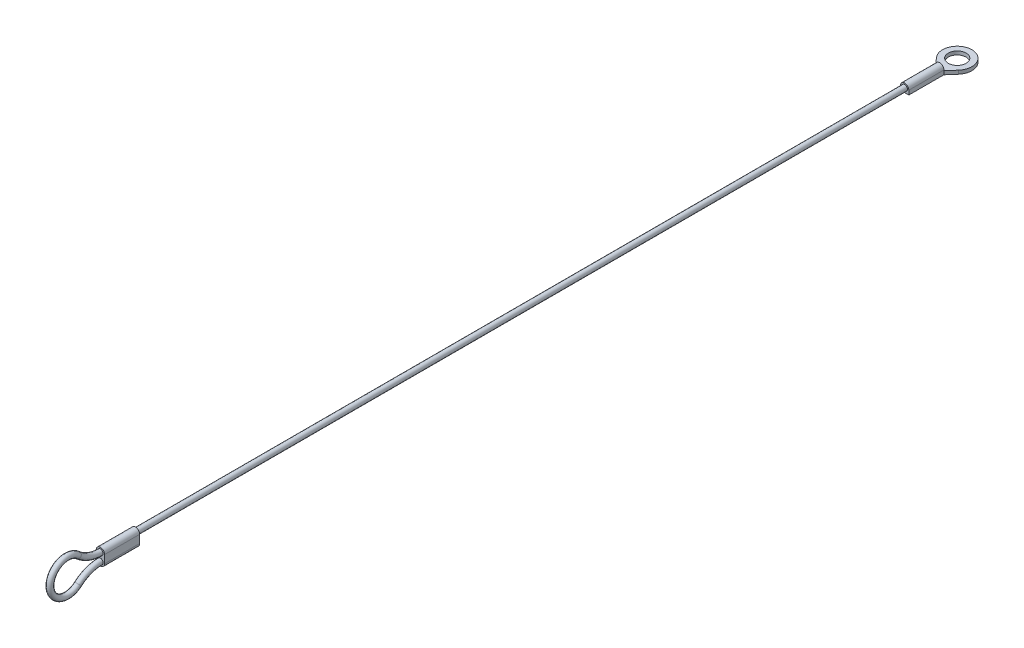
ISO-10303-21;
HEADER;
FILE_DESCRIPTION(('STEP AP214'),'2;1');
FILE_NAME('part.step','',(''),(''),'','','');
FILE_SCHEMA(('AUTOMOTIVE_DESIGN { 1 0 10303 214 1 1 1 1 }'));
ENDSEC;
DATA;
#1=APPLICATION_CONTEXT('core data for automotive mechanical design processes');
#2=APPLICATION_PROTOCOL_DEFINITION('international standard','automotive_design',2000,#1);
#3=PRODUCT_CONTEXT('',#1,'mechanical');
#4=PRODUCT('Part','Part','',(#3));
#5=PRODUCT_RELATED_PRODUCT_CATEGORY('part','',(#4));
#6=PRODUCT_DEFINITION_FORMATION('','',#4);
#7=PRODUCT_DEFINITION_CONTEXT('part definition',#1,'design');
#8=PRODUCT_DEFINITION('design','',#6,#7);
#9=PRODUCT_DEFINITION_SHAPE('','',#8);
#10=(LENGTH_UNIT() NAMED_UNIT(*) SI_UNIT(.MILLI.,.METRE.));
#11=(NAMED_UNIT(*) PLANE_ANGLE_UNIT() SI_UNIT($,.RADIAN.));
#12=(NAMED_UNIT(*) SI_UNIT($,.STERADIAN.) SOLID_ANGLE_UNIT());
#13=UNCERTAINTY_MEASURE_WITH_UNIT(LENGTH_MEASURE(1.E-05),#10,'distance_accuracy_value','');
#14=(GEOMETRIC_REPRESENTATION_CONTEXT(3) GLOBAL_UNCERTAINTY_ASSIGNED_CONTEXT((#13)) GLOBAL_UNIT_ASSIGNED_CONTEXT((#10,
#11,#12)) REPRESENTATION_CONTEXT('',''));
#15=CARTESIAN_POINT('',(0.,0.,0.));
#16=DIRECTION('',(0.,0.,1.));
#17=DIRECTION('',(1.,0.,0.));
#18=AXIS2_PLACEMENT_3D('',#15,#16,#17);
#19=CARTESIAN_POINT('',(0.,0.,-10.));
#20=DIRECTION('',(0.,0.,-1.));
#21=DIRECTION('',(-1.,0.,0.));
#22=AXIS2_PLACEMENT_3D('',#19,#20,#21);
#23=PLANE('',#22);
#24=DIRECTION('',(0.,-1.,0.));
#25=VECTOR('',#24,1.);
#26=CARTESIAN_POINT('',(1.195,0.,-10.));
#27=LINE('',#26,#25);
#28=CARTESIAN_POINT('',(1.195,0.,-10.));
#29=VERTEX_POINT('',#28);
#30=CARTESIAN_POINT('',(1.195,-0.185,-10.));
#31=VERTEX_POINT('',#30);
#32=EDGE_CURVE('E188',#29,#31,#27,.T.);
#33=ORIENTED_EDGE('',*,*,#32,.T.);
#34=DIRECTION('',(-1.,0.,0.));
#35=VECTOR('',#34,1.);
#36=CARTESIAN_POINT('',(-1.195,-0.185,-10.));
#37=LINE('',#36,#35);
#38=CARTESIAN_POINT('',(-1.195,-0.185,-10.));
#39=VERTEX_POINT('',#38);
#40=EDGE_CURVE('E146',#31,#39,#37,.T.);
#41=ORIENTED_EDGE('',*,*,#40,.T.);
#42=DIRECTION('',(0.,1.,0.));
#43=VECTOR('',#42,1.);
#44=CARTESIAN_POINT('',(-1.195,-1.195,-10.));
#45=LINE('',#44,#43);
#46=CARTESIAN_POINT('',(-1.195,0.,-10.));
#47=VERTEX_POINT('',#46);
#48=EDGE_CURVE('E193',#39,#47,#45,.T.);
#49=ORIENTED_EDGE('',*,*,#48,.T.);
#50=CARTESIAN_POINT('',(0.,0.,-10.));
#51=DIRECTION('',(0.,0.,-1.));
#52=DIRECTION('',(-1.,0.,0.));
#53=AXIS2_PLACEMENT_3D('',#50,#51,#52);
#54=CIRCLE('',#53,1.195);
#55=EDGE_CURVE('E184',#47,#29,#54,.T.);
#56=ORIENTED_EDGE('',*,*,#55,.T.);
#57=EDGE_LOOP('',(#33,#41,#49,#56));
#58=FACE_BOUND('',#57,.T.);
#59=ADVANCED_FACE('F39',(#58),#23,.T.);
#60=CARTESIAN_POINT('',(0.,0.,229.4));
#61=DIRECTION('',(0.,0.,-1.));
#62=DIRECTION('',(-1.,0.,0.));
#63=AXIS2_PLACEMENT_3D('',#60,#61,#62);
#64=CYLINDRICAL_SURFACE('',#63,0.795);
#65=CARTESIAN_POINT('',(0.,0.,219.4));
#66=DIRECTION('',(0.,0.,-1.));
#67=DIRECTION('',(0.,1.,0.));
#68=AXIS2_PLACEMENT_3D('',#65,#66,#67);
#69=CIRCLE('',#68,0.795);
#70=CARTESIAN_POINT('',(0.,0.795,219.4));
#71=VERTEX_POINT('',#70);
#72=EDGE_CURVE('E43',#71,#71,#69,.T.);
#73=ORIENTED_EDGE('',*,*,#72,.T.);
#74=EDGE_LOOP('',(#73));
#75=FACE_BOUND('',#74,.T.);
#76=CARTESIAN_POINT('',(0.,0.,0.));
#77=DIRECTION('',(0.,0.,1.));
#78=DIRECTION('',(1.,0.,0.));
#79=AXIS2_PLACEMENT_3D('',#76,#77,#78);
#80=CIRCLE('',#79,0.795);
#81=CARTESIAN_POINT('',(0.795,0.,0.));
#82=VERTEX_POINT('',#81);
#83=EDGE_CURVE('E224',#82,#82,#80,.T.);
#84=ORIENTED_EDGE('',*,*,#83,.T.);
#85=EDGE_LOOP('',(#84));
#86=FACE_BOUND('',#85,.T.);
#87=ADVANCED_FACE('F41',(#75,#86),#64,.T.);
#88=CARTESIAN_POINT('',(0.,2.65962020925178E-12,219.4));
#89=DIRECTION('',(0.,0.,1.));
#90=DIRECTION('',(0.,-1.,0.));
#91=AXIS2_PLACEMENT_3D('',#88,#89,#90);
#92=CYLINDRICAL_SURFACE('',#91,1.195);
#93=CARTESIAN_POINT('',(0.,2.67407623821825E-12,229.4));
#94=DIRECTION('',(0.,0.,-1.));
#95=DIRECTION('',(0.,1.,0.));
#96=AXIS2_PLACEMENT_3D('',#93,#94,#95);
#97=CIRCLE('',#96,1.195);
#98=CARTESIAN_POINT('',(-1.195,2.67422258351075E-12,229.4));
#99=VERTEX_POINT('',#98);
#100=CARTESIAN_POINT('',(1.195,2.67392989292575E-12,229.4));
#101=VERTEX_POINT('',#100);
#102=EDGE_CURVE('E236',#99,#101,#97,.T.);
#103=ORIENTED_EDGE('',*,*,#102,.T.);
#104=DIRECTION('',(0.,0.,1.));
#105=VECTOR('',#104,1.);
#106=CARTESIAN_POINT('',(1.195,2.65947386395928E-12,219.4));
#107=LINE('',#106,#105);
#108=CARTESIAN_POINT('',(1.195,2.65947386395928E-12,219.4));
#109=VERTEX_POINT('',#108);
#110=EDGE_CURVE('E257',#109,#101,#107,.T.);
#111=ORIENTED_EDGE('',*,*,#110,.F.);
#112=CARTESIAN_POINT('',(0.,2.65962020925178E-12,219.4));
#113=DIRECTION('',(0.,0.,-1.));
#114=DIRECTION('',(0.,1.,0.));
#115=AXIS2_PLACEMENT_3D('',#112,#113,#114);
#116=CIRCLE('',#115,1.195);
#117=CARTESIAN_POINT('',(-1.195,2.65976655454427E-12,219.4));
#118=VERTEX_POINT('',#117);
#119=EDGE_CURVE('E225',#118,#109,#116,.T.);
#120=ORIENTED_EDGE('',*,*,#119,.F.);
#121=DIRECTION('',(0.,0.,1.));
#122=VECTOR('',#121,1.);
#123=CARTESIAN_POINT('',(-1.195,2.65976655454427E-12,219.4));
#124=LINE('',#123,#122);
#125=EDGE_CURVE('E235',#118,#99,#124,.T.);
#126=ORIENTED_EDGE('',*,*,#125,.T.);
#127=EDGE_LOOP('',(#103,#111,#120,#126));
#128=FACE_BOUND('',#127,.T.);
#129=ADVANCED_FACE('F325',(#128),#92,.T.);
#130=CARTESIAN_POINT('',(1.195,2.65947386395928E-12,219.4));
#131=DIRECTION('',(-1.,0.,0.));
#132=DIRECTION('',(0.,-1.,0.));
#133=AXIS2_PLACEMENT_3D('',#130,#131,#132);
#134=PLANE('',#133);
#135=DIRECTION('',(0.,-1.,0.));
#136=VECTOR('',#135,1.);
#137=CARTESIAN_POINT('',(1.195,2.67392989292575E-12,229.4));
#138=LINE('',#137,#136);
#139=CARTESIAN_POINT('',(1.195,-2.26625258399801,229.4));
#140=VERTEX_POINT('',#139);
#141=EDGE_CURVE('E240',#101,#140,#138,.T.);
#142=ORIENTED_EDGE('',*,*,#141,.T.);
#143=DIRECTION('',(0.,0.,1.));
#144=VECTOR('',#143,1.);
#145=CARTESIAN_POINT('',(1.195,-2.26625258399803,219.4));
#146=LINE('',#145,#144);
#147=CARTESIAN_POINT('',(1.195,-2.26625258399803,219.4));
#148=VERTEX_POINT('',#147);
#149=EDGE_CURVE('E253',#148,#140,#146,.T.);
#150=ORIENTED_EDGE('',*,*,#149,.F.);
#151=DIRECTION('',(0.,-1.,0.));
#152=VECTOR('',#151,1.);
#153=CARTESIAN_POINT('',(1.195,2.65947386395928E-12,219.4));
#154=LINE('',#153,#152);
#155=EDGE_CURVE('E95',#109,#148,#154,.T.);
#156=ORIENTED_EDGE('',*,*,#155,.F.);
#157=ORIENTED_EDGE('',*,*,#110,.T.);
#158=EDGE_LOOP('',(#142,#150,#156,#157));
#159=FACE_BOUND('',#158,.T.);
#160=ADVANCED_FACE('F449',(#159),#134,.F.);
#161=CARTESIAN_POINT('',(0.,-2.26625258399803,219.4));
#162=DIRECTION('',(0.,0.,1.));
#163=DIRECTION('',(0.,-1.,0.));
#164=AXIS2_PLACEMENT_3D('',#161,#162,#163);
#165=CYLINDRICAL_SURFACE('',#164,1.195);
#166=CARTESIAN_POINT('',(0.,-2.26625258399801,229.4));
#167=DIRECTION('',(0.,0.,-1.));
#168=DIRECTION('',(0.,1.,0.));
#169=AXIS2_PLACEMENT_3D('',#166,#167,#168);
#170=CIRCLE('',#169,1.195);
#171=CARTESIAN_POINT('',(-1.195,-2.26625258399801,229.4));
#172=VERTEX_POINT('',#171);
#173=EDGE_CURVE('E243',#140,#172,#170,.T.);
#174=ORIENTED_EDGE('',*,*,#173,.T.);
#175=DIRECTION('',(0.,0.,1.));
#176=VECTOR('',#175,1.);
#177=CARTESIAN_POINT('',(-1.195,-2.26625258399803,219.4));
#178=LINE('',#177,#176);
#179=CARTESIAN_POINT('',(-1.195,-2.26625258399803,219.4));
#180=VERTEX_POINT('',#179);
#181=EDGE_CURVE('E250',#180,#172,#178,.T.);
#182=ORIENTED_EDGE('',*,*,#181,.F.);
#183=CARTESIAN_POINT('',(0.,-2.26625258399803,219.4));
#184=DIRECTION('',(0.,0.,-1.));
#185=DIRECTION('',(0.,1.,0.));
#186=AXIS2_PLACEMENT_3D('',#183,#184,#185);
#187=CIRCLE('',#186,1.195);
#188=EDGE_CURVE('E230',#148,#180,#187,.T.);
#189=ORIENTED_EDGE('',*,*,#188,.F.);
#190=ORIENTED_EDGE('',*,*,#149,.T.);
#191=EDGE_LOOP('',(#174,#182,#189,#190));
#192=FACE_BOUND('',#191,.T.);
#193=ADVANCED_FACE('F440',(#192),#165,.T.);
#194=CARTESIAN_POINT('',(-1.195,2.65976655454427E-12,219.4));
#195=DIRECTION('',(1.,0.,0.));
#196=DIRECTION('',(0.,0.,-1.));
#197=AXIS2_PLACEMENT_3D('',#194,#195,#196);
#198=PLANE('',#197);
#199=DIRECTION('',(0.,1.,0.));
#200=VECTOR('',#199,1.);
#201=CARTESIAN_POINT('',(-1.195,2.67422258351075E-12,229.4));
#202=LINE('',#201,#200);
#203=EDGE_CURVE('E87',#172,#99,#202,.T.);
#204=ORIENTED_EDGE('',*,*,#203,.T.);
#205=ORIENTED_EDGE('',*,*,#125,.F.);
#206=DIRECTION('',(0.,1.,0.));
#207=VECTOR('',#206,1.);
#208=CARTESIAN_POINT('',(-1.195,2.65976655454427E-12,219.4));
#209=LINE('',#208,#207);
#210=EDGE_CURVE('E66',#180,#118,#209,.T.);
#211=ORIENTED_EDGE('',*,*,#210,.F.);
#212=ORIENTED_EDGE('',*,*,#181,.T.);
#213=EDGE_LOOP('',(#204,#205,#211,#212));
#214=FACE_BOUND('',#213,.T.);
#215=ADVANCED_FACE('F430',(#214),#198,.F.);
#216=CARTESIAN_POINT('',(0.,2.65962020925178E-12,219.4));
#217=DIRECTION('',(0.,0.,-1.));
#218=DIRECTION('',(0.,1.,0.));
#219=AXIS2_PLACEMENT_3D('',#216,#217,#218);
#220=PLANE('',#219);
#221=ORIENTED_EDGE('',*,*,#72,.F.);
#222=EDGE_LOOP('',(#221));
#223=FACE_BOUND('',#222,.T.);
#224=ORIENTED_EDGE('',*,*,#119,.T.);
#225=ORIENTED_EDGE('',*,*,#155,.T.);
#226=ORIENTED_EDGE('',*,*,#188,.T.);
#227=ORIENTED_EDGE('',*,*,#210,.T.);
#228=EDGE_LOOP('',(#224,#225,#226,#227));
#229=FACE_BOUND('',#228,.T.);
#230=ADVANCED_FACE('F419',(#223,#229),#220,.T.);
#231=CARTESIAN_POINT('',(0.,2.67407623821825E-12,229.4));
#232=DIRECTION('',(0.,0.,-1.));
#233=DIRECTION('',(0.,1.,0.));
#234=AXIS2_PLACEMENT_3D('',#231,#232,#233);
#235=PLANE('',#234);
#236=CARTESIAN_POINT('',(0.,-2.26625258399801,229.4));
#237=DIRECTION('',(0.,0.,-1.));
#238=DIRECTION('',(1.,0.,0.));
#239=AXIS2_PLACEMENT_3D('',#236,#237,#238);
#240=CIRCLE('',#239,0.795);
#241=CARTESIAN_POINT('',(0.,-1.47125258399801,229.4));
#242=VERTEX_POINT('',#241);
#243=EDGE_CURVE('E263',#242,#242,#240,.T.);
#244=ORIENTED_EDGE('',*,*,#243,.T.);
#245=EDGE_LOOP('',(#244));
#246=FACE_BOUND('',#245,.T.);
#247=CARTESIAN_POINT('',(0.,0.,229.4));
#248=DIRECTION('',(0.,0.,-1.));
#249=DIRECTION('',(0.,1.,0.));
#250=AXIS2_PLACEMENT_3D('',#247,#248,#249);
#251=CIRCLE('',#250,0.795);
#252=CARTESIAN_POINT('',(0.,-0.795000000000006,229.4));
#253=VERTEX_POINT('',#252);
#254=EDGE_CURVE('E260',#253,#253,#251,.T.);
#255=ORIENTED_EDGE('',*,*,#254,.T.);
#256=EDGE_LOOP('',(#255));
#257=FACE_BOUND('',#256,.T.);
#258=ORIENTED_EDGE('',*,*,#102,.F.);
#259=ORIENTED_EDGE('',*,*,#203,.F.);
#260=ORIENTED_EDGE('',*,*,#173,.F.);
#261=ORIENTED_EDGE('',*,*,#141,.F.);
#262=EDGE_LOOP('',(#258,#259,#260,#261));
#263=FACE_BOUND('',#262,.T.);
#264=ADVANCED_FACE('F413',(#246,#257,#263),#235,.F.);
#265=CARTESIAN_POINT('',(0.,-11.866252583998,229.4));
#266=DIRECTION('',(1.,0.,0.));
#267=DIRECTION('',(0.,0.,-1.));
#268=AXIS2_PLACEMENT_3D('',#265,#266,#267);
#269=TOROIDAL_SURFACE('',#268,9.6,0.795);
#270=CARTESIAN_POINT('',(0.,-4.71083505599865,235.8));
#271=DIRECTION('',(0.,0.666666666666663,-0.745355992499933));
#272=DIRECTION('',(1.,0.,0.));
#273=AXIS2_PLACEMENT_3D('',#270,#271,#272);
#274=CIRCLE('',#273,0.795);
#275=CARTESIAN_POINT('',(0.,-4.1182770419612,236.33));
#276=VERTEX_POINT('',#275);
#277=EDGE_CURVE('E49',#276,#276,#274,.T.);
#278=CARTESIAN_POINT('',(0.,-11.866252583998,229.4));
#279=DIRECTION('',(1.,0.,0.));
#280=DIRECTION('',(0.,0.,-1.));
#281=AXIS2_PLACEMENT_3D('',#278,#279,#280);
#282=CIRCLE('',#281,10.395);
#283=EDGE_CURVE('',#242,#276,#282,.T.);
#284=ORIENTED_EDGE('',*,*,#243,.F.);
#285=ORIENTED_EDGE('',*,*,#277,.T.);
#286=ORIENTED_EDGE('',*,*,#283,.T.);
#287=ORIENTED_EDGE('',*,*,#283,.F.);
#288=EDGE_LOOP('',(#284,#286,#285,#287));
#289=FACE_BOUND('',#288,.T.);
#290=ADVANCED_FACE('F418',(#289),#269,.T.);
#291=CARTESIAN_POINT('',(0.,-1.13312629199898,239.));
#292=DIRECTION('',(-1.,0.,0.));
#293=DIRECTION('',(0.,0.,1.));
#294=AXIS2_PLACEMENT_3D('',#291,#292,#293);
#295=TOROIDAL_SURFACE('',#294,4.79999999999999,0.795);
#296=CARTESIAN_POINT('',(0.,2.44458247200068,235.8));
#297=DIRECTION('',(0.,0.666666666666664,0.745355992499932));
#298=DIRECTION('',(1.,0.,0.));
#299=AXIS2_PLACEMENT_3D('',#296,#297,#298);
#300=CIRCLE('',#299,0.795);
#301=CARTESIAN_POINT('',(0.,1.85202445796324,236.33));
#302=VERTEX_POINT('',#301);
#303=EDGE_CURVE('E11',#302,#302,#300,.T.);
#304=ORIENTED_EDGE('',*,*,#303,.T.);
#305=EDGE_LOOP('',(#304));
#306=FACE_BOUND('',#305,.T.);
#307=ORIENTED_EDGE('',*,*,#277,.F.);
#308=EDGE_LOOP('',(#307));
#309=FACE_BOUND('',#308,.T.);
#310=ADVANCED_FACE('F480',(#306,#309),#295,.T.);
#311=CARTESIAN_POINT('',(0.,9.6,229.4));
#312=DIRECTION('',(1.,0.,0.));
#313=DIRECTION('',(0.,0.,-1.));
#314=AXIS2_PLACEMENT_3D('',#311,#312,#313);
#315=TOROIDAL_SURFACE('',#314,9.6,0.795);
#316=CARTESIAN_POINT('',(0.,9.6,229.4));
#317=DIRECTION('',(1.,0.,0.));
#318=DIRECTION('',(0.,0.,-1.));
#319=AXIS2_PLACEMENT_3D('',#316,#317,#318);
#320=CIRCLE('',#319,10.395);
#321=EDGE_CURVE('',#302,#253,#320,.T.);
#322=ORIENTED_EDGE('',*,*,#303,.F.);
#323=ORIENTED_EDGE('',*,*,#254,.F.);
#324=ORIENTED_EDGE('',*,*,#321,.T.);
#325=ORIENTED_EDGE('',*,*,#321,.F.);
#326=EDGE_LOOP('',(#322,#324,#323,#325));
#327=FACE_BOUND('',#326,.T.);
#328=ADVANCED_FACE('F407',(#327),#315,.T.);
#329=CARTESIAN_POINT('',(0.,0.,-10.));
#330=DIRECTION('',(0.,0.,1.));
#331=DIRECTION('',(1.,0.,0.));
#332=AXIS2_PLACEMENT_3D('',#329,#330,#331);
#333=CYLINDRICAL_SURFACE('',#332,1.195);
#334=CARTESIAN_POINT('',(0.,0.,0.));
#335=DIRECTION('',(0.,0.,-1.));
#336=DIRECTION('',(-1.,0.,0.));
#337=AXIS2_PLACEMENT_3D('',#334,#335,#336);
#338=CIRCLE('',#337,1.195);
#339=CARTESIAN_POINT('',(-1.195,0.,0.));
#340=VERTEX_POINT('',#339);
#341=CARTESIAN_POINT('',(1.195,0.,0.));
#342=VERTEX_POINT('',#341);
#343=EDGE_CURVE('E181',#340,#342,#338,.T.);
#344=ORIENTED_EDGE('',*,*,#343,.T.);
#345=DIRECTION('',(0.,0.,1.));
#346=VECTOR('',#345,1.);
#347=CARTESIAN_POINT('',(1.195,0.,-10.));
#348=LINE('',#347,#346);
#349=EDGE_CURVE('E220',#29,#342,#348,.T.);
#350=ORIENTED_EDGE('',*,*,#349,.F.);
#351=ORIENTED_EDGE('',*,*,#55,.F.);
#352=DIRECTION('',(0.,0.,1.));
#353=VECTOR('',#352,1.);
#354=CARTESIAN_POINT('',(-1.195,0.,-10.));
#355=LINE('',#354,#353);
#356=EDGE_CURVE('E196',#47,#340,#355,.T.);
#357=ORIENTED_EDGE('',*,*,#356,.T.);
#358=EDGE_LOOP('',(#344,#350,#351,#357));
#359=FACE_BOUND('',#358,.T.);
#360=ADVANCED_FACE('F283',(#359),#333,.T.);
#361=CARTESIAN_POINT('',(1.195,0.,-10.));
#362=DIRECTION('',(-1.,0.,0.));
#363=DIRECTION('',(0.,-1.,0.));
#364=AXIS2_PLACEMENT_3D('',#361,#362,#363);
#365=PLANE('',#364);
#366=DIRECTION('',(0.,-1.,0.));
#367=VECTOR('',#366,1.);
#368=CARTESIAN_POINT('',(1.195,0.,0.));
#369=LINE('',#368,#367);
#370=CARTESIAN_POINT('',(1.195,-1.195,0.));
#371=VERTEX_POINT('',#370);
#372=EDGE_CURVE('E200',#342,#371,#369,.T.);
#373=ORIENTED_EDGE('',*,*,#372,.T.);
#374=DIRECTION('',(0.,0.,1.));
#375=VECTOR('',#374,1.);
#376=CARTESIAN_POINT('',(1.195,-1.195,-10.));
#377=LINE('',#376,#375);
#378=CARTESIAN_POINT('',(1.195,-1.195,-10.));
#379=VERTEX_POINT('',#378);
#380=EDGE_CURVE('E216',#379,#371,#377,.T.);
#381=ORIENTED_EDGE('',*,*,#380,.F.);
#382=DIRECTION('',(0.,-1.,0.));
#383=VECTOR('',#382,1.);
#384=CARTESIAN_POINT('',(1.195,-0.185,-10.));
#385=LINE('',#384,#383);
#386=EDGE_CURVE('E179',#31,#379,#385,.T.);
#387=ORIENTED_EDGE('',*,*,#386,.F.);
#388=ORIENTED_EDGE('',*,*,#32,.F.);
#389=ORIENTED_EDGE('',*,*,#349,.T.);
#390=EDGE_LOOP('',(#373,#381,#387,#388,#389));
#391=FACE_BOUND('',#390,.T.);
#392=ADVANCED_FACE('F294',(#391),#365,.F.);
#393=CARTESIAN_POINT('',(0.,-1.195,-10.));
#394=DIRECTION('',(0.,1.,0.));
#395=DIRECTION('',(0.,0.,1.));
#396=AXIS2_PLACEMENT_3D('',#393,#394,#395);
#397=PLANE('',#396);
#398=DIRECTION('',(-1.,0.,0.));
#399=VECTOR('',#398,1.);
#400=CARTESIAN_POINT('',(0.,-1.195,0.));
#401=LINE('',#400,#399);
#402=CARTESIAN_POINT('',(-1.195,-1.195,0.));
#403=VERTEX_POINT('',#402);
#404=EDGE_CURVE('E204',#371,#403,#401,.T.);
#405=ORIENTED_EDGE('',*,*,#404,.T.);
#406=DIRECTION('',(0.,0.,1.));
#407=VECTOR('',#406,1.);
#408=CARTESIAN_POINT('',(-1.195,-1.195,-10.));
#409=LINE('',#408,#407);
#410=CARTESIAN_POINT('',(-1.195,-1.195,-10.));
#411=VERTEX_POINT('',#410);
#412=EDGE_CURVE('E212',#411,#403,#409,.T.);
#413=ORIENTED_EDGE('',*,*,#412,.F.);
#414=DIRECTION('',(-0.658036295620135,0.,-0.752986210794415));
#415=VECTOR('',#414,1.);
#416=CARTESIAN_POINT('',(-3.15501222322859,-1.195,-12.2428279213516));
#417=LINE('',#416,#415);
#418=CARTESIAN_POINT('',(-3.1550122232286,-1.195,-12.2428279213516));
#419=VERTEX_POINT('',#418);
#420=EDGE_CURVE('E173',#411,#419,#417,.T.);
#421=ORIENTED_EDGE('',*,*,#420,.T.);
#422=CARTESIAN_POINT('',(0.,-1.195,-15.));
#423=DIRECTION('',(0.,-1.,0.));
#424=DIRECTION('',(0.,0.,1.));
#425=AXIS2_PLACEMENT_3D('',#422,#423,#424);
#426=CIRCLE('',#425,4.19);
#427=CARTESIAN_POINT('',(3.15501222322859,-1.195,-12.2428279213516));
#428=VERTEX_POINT('',#427);
#429=EDGE_CURVE('E141',#419,#428,#426,.T.);
#430=ORIENTED_EDGE('',*,*,#429,.T.);
#431=DIRECTION('',(-0.658036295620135,0.,0.752986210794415));
#432=VECTOR('',#431,1.);
#433=CARTESIAN_POINT('',(1.195,-1.195,-10.));
#434=LINE('',#433,#432);
#435=EDGE_CURVE('E158',#428,#379,#434,.T.);
#436=ORIENTED_EDGE('',*,*,#435,.T.);
#437=ORIENTED_EDGE('',*,*,#380,.T.);
#438=EDGE_LOOP('',(#405,#413,#421,#430,#436,#437));
#439=FACE_BOUND('',#438,.T.);
#440=CARTESIAN_POINT('',(0.,-1.195,-15.));
#441=DIRECTION('',(0.,-1.,0.));
#442=DIRECTION('',(0.,0.,-1.));
#443=AXIS2_PLACEMENT_3D('',#440,#441,#442);
#444=CIRCLE('',#443,2.54);
#445=CARTESIAN_POINT('',(0.,-1.195,-17.54));
#446=VERTEX_POINT('',#445);
#447=EDGE_CURVE('E166',#446,#446,#444,.T.);
#448=ORIENTED_EDGE('',*,*,#447,.F.);
#449=EDGE_LOOP('',(#448));
#450=FACE_BOUND('',#449,.T.);
#451=ADVANCED_FACE('F290',(#439,#450),#397,.F.);
#452=CARTESIAN_POINT('',(-1.195,-1.195,-10.));
#453=DIRECTION('',(1.,0.,0.));
#454=DIRECTION('',(0.,1.,0.));
#455=AXIS2_PLACEMENT_3D('',#452,#453,#454);
#456=PLANE('',#455);
#457=DIRECTION('',(0.,1.,0.));
#458=VECTOR('',#457,1.);
#459=CARTESIAN_POINT('',(-1.195,-1.195,0.));
#460=LINE('',#459,#458);
#461=EDGE_CURVE('E189',#403,#340,#460,.T.);
#462=ORIENTED_EDGE('',*,*,#461,.T.);
#463=ORIENTED_EDGE('',*,*,#356,.F.);
#464=ORIENTED_EDGE('',*,*,#48,.F.);
#465=EDGE_CURVE('E155',#411,#39,#45,.T.);
#466=ORIENTED_EDGE('',*,*,#465,.F.);
#467=ORIENTED_EDGE('',*,*,#412,.T.);
#468=EDGE_LOOP('',(#462,#463,#464,#466,#467));
#469=FACE_BOUND('',#468,.T.);
#470=ADVANCED_FACE('F277',(#469),#456,.F.);
#471=CARTESIAN_POINT('',(0.,0.,0.));
#472=DIRECTION('',(0.,0.,-1.));
#473=DIRECTION('',(-1.,0.,0.));
#474=AXIS2_PLACEMENT_3D('',#471,#472,#473);
#475=PLANE('',#474);
#476=ORIENTED_EDGE('',*,*,#83,.F.);
#477=EDGE_LOOP('',(#476));
#478=FACE_BOUND('',#477,.T.);
#479=ORIENTED_EDGE('',*,*,#343,.F.);
#480=ORIENTED_EDGE('',*,*,#461,.F.);
#481=ORIENTED_EDGE('',*,*,#404,.F.);
#482=ORIENTED_EDGE('',*,*,#372,.F.);
#483=EDGE_LOOP('',(#479,#480,#481,#482));
#484=FACE_BOUND('',#483,.T.);
#485=ADVANCED_FACE('F274',(#478,#484),#475,.F.);
#486=CARTESIAN_POINT('',(-3.15501222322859,-0.185,-12.2428279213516));
#487=DIRECTION('',(-0.752986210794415,0.,0.658036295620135));
#488=DIRECTION('',(0.658036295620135,0.,0.752986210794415));
#489=AXIS2_PLACEMENT_3D('',#486,#487,#488);
#490=PLANE('',#489);
#491=ORIENTED_EDGE('',*,*,#420,.F.);
#492=ORIENTED_EDGE('',*,*,#465,.T.);
#493=DIRECTION('',(-0.658036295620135,0.,-0.752986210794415));
#494=VECTOR('',#493,1.);
#495=CARTESIAN_POINT('',(-3.15501222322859,-0.185,-12.2428279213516));
#496=LINE('',#495,#494);
#497=CARTESIAN_POINT('',(-3.1550122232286,-0.185,-12.2428279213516));
#498=VERTEX_POINT('',#497);
#499=EDGE_CURVE('E57',#39,#498,#496,.T.);
#500=ORIENTED_EDGE('',*,*,#499,.T.);
#501=DIRECTION('',(0.,-1.,0.));
#502=VECTOR('',#501,1.);
#503=CARTESIAN_POINT('',(-3.1550122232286,-0.185,-12.2428279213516));
#504=LINE('',#503,#502);
#505=EDGE_CURVE('E137',#498,#419,#504,.T.);
#506=ORIENTED_EDGE('',*,*,#505,.T.);
#507=EDGE_LOOP('',(#491,#492,#500,#506));
#508=FACE_BOUND('',#507,.T.);
#509=ADVANCED_FACE('F153',(#508),#490,.T.);
#510=CARTESIAN_POINT('',(1.195,-0.185,-10.));
#511=DIRECTION('',(0.752986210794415,0.,0.658036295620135));
#512=DIRECTION('',(0.658036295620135,0.,-0.752986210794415));
#513=AXIS2_PLACEMENT_3D('',#510,#511,#512);
#514=PLANE('',#513);
#515=ORIENTED_EDGE('',*,*,#435,.F.);
#516=DIRECTION('',(0.,-1.,0.));
#517=VECTOR('',#516,1.);
#518=CARTESIAN_POINT('',(3.15501222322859,-0.185,-12.2428279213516));
#519=LINE('',#518,#517);
#520=CARTESIAN_POINT('',(3.15501222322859,-0.185,-12.2428279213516));
#521=VERTEX_POINT('',#520);
#522=EDGE_CURVE('E145',#521,#428,#519,.T.);
#523=ORIENTED_EDGE('',*,*,#522,.F.);
#524=DIRECTION('',(-0.658036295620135,0.,0.752986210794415));
#525=VECTOR('',#524,1.);
#526=CARTESIAN_POINT('',(1.195,-0.185,-10.));
#527=LINE('',#526,#525);
#528=EDGE_CURVE('E150',#521,#31,#527,.T.);
#529=ORIENTED_EDGE('',*,*,#528,.T.);
#530=ORIENTED_EDGE('',*,*,#386,.T.);
#531=EDGE_LOOP('',(#515,#523,#529,#530));
#532=FACE_BOUND('',#531,.T.);
#533=ADVANCED_FACE('F330',(#532),#514,.T.);
#534=CARTESIAN_POINT('',(0.,-0.185,-15.));
#535=DIRECTION('',(0.,-1.,0.));
#536=DIRECTION('',(0.,0.,-1.));
#537=AXIS2_PLACEMENT_3D('',#534,#535,#536);
#538=CYLINDRICAL_SURFACE('',#537,4.19);
#539=ORIENTED_EDGE('',*,*,#429,.F.);
#540=ORIENTED_EDGE('',*,*,#505,.F.);
#541=CARTESIAN_POINT('',(0.,-0.185,-15.));
#542=DIRECTION('',(0.,-1.,0.));
#543=DIRECTION('',(0.,0.,1.));
#544=AXIS2_PLACEMENT_3D('',#541,#542,#543);
#545=CIRCLE('',#544,4.19);
#546=EDGE_CURVE('E139',#498,#521,#545,.T.);
#547=ORIENTED_EDGE('',*,*,#546,.T.);
#548=ORIENTED_EDGE('',*,*,#522,.T.);
#549=EDGE_LOOP('',(#539,#540,#547,#548));
#550=FACE_BOUND('',#549,.T.);
#551=ADVANCED_FACE('F138',(#550),#538,.T.);
#552=CARTESIAN_POINT('',(0.,-0.185,-15.));
#553=DIRECTION('',(0.,1.,0.));
#554=DIRECTION('',(0.,0.,1.));
#555=AXIS2_PLACEMENT_3D('',#552,#553,#554);
#556=PLANE('',#555);
#557=CARTESIAN_POINT('',(0.,-0.185,-15.));
#558=DIRECTION('',(0.,-1.,0.));
#559=DIRECTION('',(0.,0.,-1.));
#560=AXIS2_PLACEMENT_3D('',#557,#558,#559);
#561=CIRCLE('',#560,2.54);
#562=CARTESIAN_POINT('',(0.,-0.185,-17.54));
#563=VERTEX_POINT('',#562);
#564=EDGE_CURVE('E176',#563,#563,#561,.T.);
#565=ORIENTED_EDGE('',*,*,#564,.T.);
#566=EDGE_LOOP('',(#565));
#567=FACE_BOUND('',#566,.T.);
#568=ORIENTED_EDGE('',*,*,#499,.F.);
#569=ORIENTED_EDGE('',*,*,#40,.F.);
#570=ORIENTED_EDGE('',*,*,#528,.F.);
#571=ORIENTED_EDGE('',*,*,#546,.F.);
#572=EDGE_LOOP('',(#568,#569,#570,#571));
#573=FACE_BOUND('',#572,.T.);
#574=ADVANCED_FACE('F149',(#567,#573),#556,.T.);
#575=CARTESIAN_POINT('',(0.,-0.185,-15.));
#576=DIRECTION('',(0.,-1.,0.));
#577=DIRECTION('',(0.,0.,-1.));
#578=AXIS2_PLACEMENT_3D('',#575,#576,#577);
#579=CYLINDRICAL_SURFACE('',#578,2.54);
#580=ORIENTED_EDGE('',*,*,#564,.F.);
#581=EDGE_LOOP('',(#580));
#582=FACE_BOUND('',#581,.T.);
#583=ORIENTED_EDGE('',*,*,#447,.T.);
#584=EDGE_LOOP('',(#583));
#585=FACE_BOUND('',#584,.T.);
#586=ADVANCED_FACE('F307',(#582,#585),#579,.F.);
#587=CLOSED_SHELL('',(#59,#87,#129,#160,#193,#215,#230,#264,#290,#310,#328,#360,#392,#451,#470,
#485,#509,#533,#551,#574,#586));
#588=MANIFOLD_SOLID_BREP('B2',#587);
#589=ADVANCED_BREP_SHAPE_REPRESENTATION('',(#18,#588),#14);
#590=SHAPE_DEFINITION_REPRESENTATION(#9,#589);
ENDSEC;
END-ISO-10303-21;
